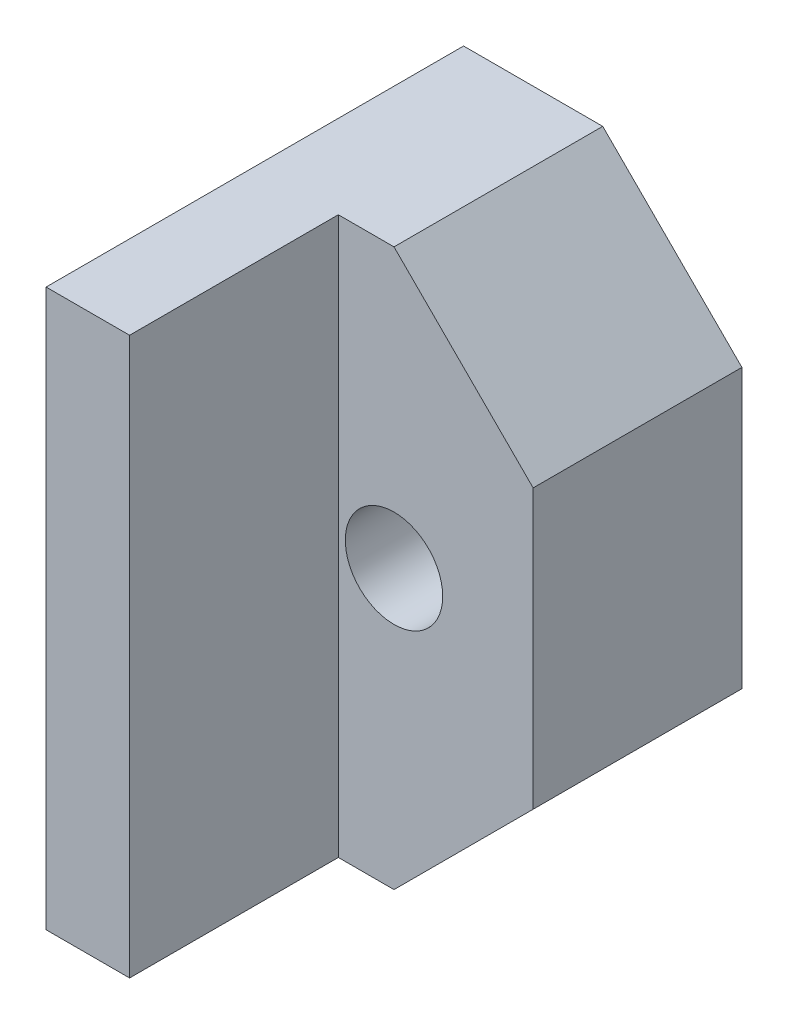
ISO-10303-21;
HEADER;
FILE_DESCRIPTION(('STEP AP214'),'2;1');
FILE_NAME('part.step','',(''),(''),'','','');
FILE_SCHEMA(('AUTOMOTIVE_DESIGN { 1 0 10303 214 1 1 1 1 }'));
ENDSEC;
DATA;
#1=APPLICATION_CONTEXT('core data for automotive mechanical design processes');
#2=APPLICATION_PROTOCOL_DEFINITION('international standard','automotive_design',2000,#1);
#3=PRODUCT_CONTEXT('',#1,'mechanical');
#4=PRODUCT('Part','Part','',(#3));
#5=PRODUCT_RELATED_PRODUCT_CATEGORY('part','',(#4));
#6=PRODUCT_DEFINITION_FORMATION('','',#4);
#7=PRODUCT_DEFINITION_CONTEXT('part definition',#1,'design');
#8=PRODUCT_DEFINITION('design','',#6,#7);
#9=PRODUCT_DEFINITION_SHAPE('','',#8);
#10=(LENGTH_UNIT() NAMED_UNIT(*) SI_UNIT(.MILLI.,.METRE.));
#11=(NAMED_UNIT(*) PLANE_ANGLE_UNIT() SI_UNIT($,.RADIAN.));
#12=(NAMED_UNIT(*) SI_UNIT($,.STERADIAN.) SOLID_ANGLE_UNIT());
#13=UNCERTAINTY_MEASURE_WITH_UNIT(LENGTH_MEASURE(1.E-05),#10,'distance_accuracy_value','');
#14=(GEOMETRIC_REPRESENTATION_CONTEXT(3) GLOBAL_UNCERTAINTY_ASSIGNED_CONTEXT((#13)) GLOBAL_UNIT_ASSIGNED_CONTEXT((#10,
#11,#12)) REPRESENTATION_CONTEXT('',''));
#15=CARTESIAN_POINT('',(0.,0.,0.));
#16=DIRECTION('',(0.,0.,1.));
#17=DIRECTION('',(1.,0.,0.));
#18=AXIS2_PLACEMENT_3D('',#15,#16,#17);
#19=CARTESIAN_POINT('',(4.,-2.,6.));
#20=DIRECTION('',(0.707106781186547,-0.707106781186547,0.));
#21=DIRECTION('',(0.707106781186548,0.707106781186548,0.));
#22=AXIS2_PLACEMENT_3D('',#19,#20,#21);
#23=PLANE('',#22);
#24=DIRECTION('',(0.,0.,-1.));
#25=VECTOR('',#24,1.);
#26=CARTESIAN_POINT('',(4.,-2.,6.));
#27=LINE('',#26,#25);
#28=CARTESIAN_POINT('',(4.,-2.,3.));
#29=VERTEX_POINT('',#28);
#30=CARTESIAN_POINT('',(4.,-2.,0.));
#31=VERTEX_POINT('',#30);
#32=EDGE_CURVE('E70',#29,#31,#27,.T.);
#33=ORIENTED_EDGE('',*,*,#32,.F.);
#34=DIRECTION('',(0.707106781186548,0.707106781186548,0.));
#35=VECTOR('',#34,1.);
#36=CARTESIAN_POINT('',(3.,-3.,3.));
#37=LINE('',#36,#35);
#38=CARTESIAN_POINT('',(2.,-4.,3.));
#39=VERTEX_POINT('',#38);
#40=EDGE_CURVE('E118',#39,#29,#37,.T.);
#41=ORIENTED_EDGE('',*,*,#40,.F.);
#42=DIRECTION('',(0.,0.,-1.));
#43=VECTOR('',#42,1.);
#44=CARTESIAN_POINT('',(2.,-4.,6.));
#45=LINE('',#44,#43);
#46=CARTESIAN_POINT('',(2.,-4.,0.));
#47=VERTEX_POINT('',#46);
#48=EDGE_CURVE('E12',#39,#47,#45,.T.);
#49=ORIENTED_EDGE('',*,*,#48,.T.);
#50=DIRECTION('',(-0.707106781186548,-0.707106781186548,0.));
#51=VECTOR('',#50,1.);
#52=CARTESIAN_POINT('',(4.,-2.,0.));
#53=LINE('',#52,#51);
#54=EDGE_CURVE('E115',#31,#47,#53,.T.);
#55=ORIENTED_EDGE('',*,*,#54,.F.);
#56=EDGE_LOOP('',(#33,#41,#49,#55));
#57=FACE_BOUND('',#56,.T.);
#58=ADVANCED_FACE('F60',(#57),#23,.T.);
#59=CARTESIAN_POINT('',(4.,2.,6.));
#60=DIRECTION('',(1.,0.,0.));
#61=DIRECTION('',(0.,0.,-1.));
#62=AXIS2_PLACEMENT_3D('',#59,#60,#61);
#63=PLANE('',#62);
#64=DIRECTION('',(0.,0.,-1.));
#65=VECTOR('',#64,1.);
#66=CARTESIAN_POINT('',(4.,2.,6.));
#67=LINE('',#66,#65);
#68=CARTESIAN_POINT('',(4.,2.,3.));
#69=VERTEX_POINT('',#68);
#70=CARTESIAN_POINT('',(4.,2.,0.));
#71=VERTEX_POINT('',#70);
#72=EDGE_CURVE('E151',#69,#71,#67,.T.);
#73=ORIENTED_EDGE('',*,*,#72,.F.);
#74=DIRECTION('',(0.,1.,0.));
#75=VECTOR('',#74,1.);
#76=CARTESIAN_POINT('',(4.,0.,3.));
#77=LINE('',#76,#75);
#78=EDGE_CURVE('E183',#29,#69,#77,.T.);
#79=ORIENTED_EDGE('',*,*,#78,.F.);
#80=ORIENTED_EDGE('',*,*,#32,.T.);
#81=DIRECTION('',(0.,-1.,0.));
#82=VECTOR('',#81,1.);
#83=CARTESIAN_POINT('',(4.,2.,0.));
#84=LINE('',#83,#82);
#85=EDGE_CURVE('E137',#71,#31,#84,.T.);
#86=ORIENTED_EDGE('',*,*,#85,.F.);
#87=EDGE_LOOP('',(#73,#79,#80,#86));
#88=FACE_BOUND('',#87,.T.);
#89=ADVANCED_FACE('F181',(#88),#63,.T.);
#90=CARTESIAN_POINT('',(2.,4.,6.));
#91=DIRECTION('',(0.707106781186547,0.707106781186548,0.));
#92=DIRECTION('',(-0.707106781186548,0.707106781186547,0.));
#93=AXIS2_PLACEMENT_3D('',#90,#91,#92);
#94=PLANE('',#93);
#95=DIRECTION('',(0.,0.,-1.));
#96=VECTOR('',#95,1.);
#97=CARTESIAN_POINT('',(2.,4.,6.));
#98=LINE('',#97,#96);
#99=CARTESIAN_POINT('',(2.,4.,3.));
#100=VERTEX_POINT('',#99);
#101=CARTESIAN_POINT('',(2.,4.,0.));
#102=VERTEX_POINT('',#101);
#103=EDGE_CURVE('E154',#100,#102,#98,.T.);
#104=ORIENTED_EDGE('',*,*,#103,.F.);
#105=DIRECTION('',(-0.707106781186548,0.707106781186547,0.));
#106=VECTOR('',#105,1.);
#107=CARTESIAN_POINT('',(3.,3.,3.));
#108=LINE('',#107,#106);
#109=EDGE_CURVE('E78',#69,#100,#108,.T.);
#110=ORIENTED_EDGE('',*,*,#109,.F.);
#111=ORIENTED_EDGE('',*,*,#72,.T.);
#112=DIRECTION('',(0.707106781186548,-0.707106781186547,0.));
#113=VECTOR('',#112,1.);
#114=CARTESIAN_POINT('',(2.,4.,0.));
#115=LINE('',#114,#113);
#116=EDGE_CURVE('E145',#102,#71,#115,.T.);
#117=ORIENTED_EDGE('',*,*,#116,.F.);
#118=EDGE_LOOP('',(#104,#110,#111,#117));
#119=FACE_BOUND('',#118,.T.);
#120=ADVANCED_FACE('F177',(#119),#94,.T.);
#121=CARTESIAN_POINT('',(2.,0.,6.));
#122=DIRECTION('',(0.,0.,-1.));
#123=DIRECTION('',(-1.,0.,0.));
#124=AXIS2_PLACEMENT_3D('',#121,#122,#123);
#125=CYLINDRICAL_SURFACE('',#124,0.7);
#126=CARTESIAN_POINT('',(2.,0.,0.));
#127=DIRECTION('',(0.,0.,1.));
#128=DIRECTION('',(1.,0.,0.));
#129=AXIS2_PLACEMENT_3D('',#126,#127,#128);
#130=CIRCLE('',#129,0.7);
#131=CARTESIAN_POINT('',(2.7,0.,0.));
#132=VERTEX_POINT('',#131);
#133=EDGE_CURVE('E130',#132,#132,#130,.T.);
#134=ORIENTED_EDGE('',*,*,#133,.F.);
#135=EDGE_LOOP('',(#134));
#136=FACE_BOUND('',#135,.T.);
#137=CARTESIAN_POINT('',(2.,0.,3.));
#138=DIRECTION('',(0.,0.,1.));
#139=DIRECTION('',(1.,0.,0.));
#140=AXIS2_PLACEMENT_3D('',#137,#138,#139);
#141=CIRCLE('',#140,0.7);
#142=CARTESIAN_POINT('',(2.7,0.,3.));
#143=VERTEX_POINT('',#142);
#144=EDGE_CURVE('E225',#143,#143,#141,.F.);
#145=ORIENTED_EDGE('',*,*,#144,.F.);
#146=EDGE_LOOP('',(#145));
#147=FACE_BOUND('',#146,.T.);
#148=ADVANCED_FACE('F233',(#136,#147),#125,.F.);
#149=CARTESIAN_POINT('',(0.,0.,6.));
#150=DIRECTION('',(0.,0.,-1.));
#151=DIRECTION('',(-1.,0.,0.));
#152=AXIS2_PLACEMENT_3D('',#149,#150,#151);
#153=PLANE('',#152);
#154=DIRECTION('',(-1.,0.,0.));
#155=VECTOR('',#154,1.);
#156=CARTESIAN_POINT('',(2.,-4.,6.));
#157=LINE('',#156,#155);
#158=CARTESIAN_POINT('',(1.2,-4.,6.));
#159=VERTEX_POINT('',#158);
#160=CARTESIAN_POINT('',(0.,-4.,6.));
#161=VERTEX_POINT('',#160);
#162=EDGE_CURVE('E139',#159,#161,#157,.T.);
#163=ORIENTED_EDGE('',*,*,#162,.F.);
#164=DIRECTION('',(0.,-1.,0.));
#165=VECTOR('',#164,1.);
#166=CARTESIAN_POINT('',(1.2,0.,6.));
#167=LINE('',#166,#165);
#168=CARTESIAN_POINT('',(1.2,4.,6.));
#169=VERTEX_POINT('',#168);
#170=EDGE_CURVE('E198',#169,#159,#167,.T.);
#171=ORIENTED_EDGE('',*,*,#170,.F.);
#172=DIRECTION('',(1.,0.,0.));
#173=VECTOR('',#172,1.);
#174=CARTESIAN_POINT('',(0.,4.,6.));
#175=LINE('',#174,#173);
#176=CARTESIAN_POINT('',(0.,4.,6.));
#177=VERTEX_POINT('',#176);
#178=EDGE_CURVE('E160',#177,#169,#175,.T.);
#179=ORIENTED_EDGE('',*,*,#178,.F.);
#180=DIRECTION('',(0.,1.,0.));
#181=VECTOR('',#180,1.);
#182=CARTESIAN_POINT('',(0.,-4.,6.));
#183=LINE('',#182,#181);
#184=EDGE_CURVE('E143',#161,#177,#183,.T.);
#185=ORIENTED_EDGE('',*,*,#184,.F.);
#186=EDGE_LOOP('',(#163,#171,#179,#185));
#187=FACE_BOUND('',#186,.T.);
#188=ADVANCED_FACE('F236',(#187),#153,.F.);
#189=CARTESIAN_POINT('',(0.,0.,0.));
#190=DIRECTION('',(0.,0.,-1.));
#191=DIRECTION('',(-1.,0.,0.));
#192=AXIS2_PLACEMENT_3D('',#189,#190,#191);
#193=PLANE('',#192);
#194=DIRECTION('',(-1.,0.,0.));
#195=VECTOR('',#194,1.);
#196=CARTESIAN_POINT('',(2.,-4.,0.));
#197=LINE('',#196,#195);
#198=CARTESIAN_POINT('',(0.,-4.,0.));
#199=VERTEX_POINT('',#198);
#200=EDGE_CURVE('E122',#47,#199,#197,.T.);
#201=ORIENTED_EDGE('',*,*,#200,.T.);
#202=DIRECTION('',(0.,1.,0.));
#203=VECTOR('',#202,1.);
#204=CARTESIAN_POINT('',(0.,-4.,0.));
#205=LINE('',#204,#203);
#206=CARTESIAN_POINT('',(0.,4.,0.));
#207=VERTEX_POINT('',#206);
#208=EDGE_CURVE('E129',#199,#207,#205,.T.);
#209=ORIENTED_EDGE('',*,*,#208,.T.);
#210=DIRECTION('',(1.,0.,0.));
#211=VECTOR('',#210,1.);
#212=CARTESIAN_POINT('',(0.,4.,0.));
#213=LINE('',#212,#211);
#214=EDGE_CURVE('E170',#207,#102,#213,.T.);
#215=ORIENTED_EDGE('',*,*,#214,.T.);
#216=ORIENTED_EDGE('',*,*,#116,.T.);
#217=ORIENTED_EDGE('',*,*,#85,.T.);
#218=ORIENTED_EDGE('',*,*,#54,.T.);
#219=EDGE_LOOP('',(#201,#209,#215,#216,#217,#218));
#220=FACE_BOUND('',#219,.T.);
#221=ORIENTED_EDGE('',*,*,#133,.T.);
#222=EDGE_LOOP('',(#221));
#223=FACE_BOUND('',#222,.T.);
#224=ADVANCED_FACE('F133',(#220,#223),#193,.T.);
#225=CARTESIAN_POINT('',(2.,-4.,6.));
#226=DIRECTION('',(0.,-1.,0.));
#227=DIRECTION('',(0.,0.,-1.));
#228=AXIS2_PLACEMENT_3D('',#225,#226,#227);
#229=PLANE('',#228);
#230=DIRECTION('',(0.,0.,1.));
#231=VECTOR('',#230,1.);
#232=CARTESIAN_POINT('',(1.2,-4.,3.));
#233=LINE('',#232,#231);
#234=CARTESIAN_POINT('',(1.2,-4.,3.));
#235=VERTEX_POINT('',#234);
#236=EDGE_CURVE('E203',#235,#159,#233,.T.);
#237=ORIENTED_EDGE('',*,*,#236,.T.);
#238=ORIENTED_EDGE('',*,*,#162,.T.);
#239=DIRECTION('',(0.,0.,-1.));
#240=VECTOR('',#239,1.);
#241=CARTESIAN_POINT('',(0.,-4.,6.));
#242=LINE('',#241,#240);
#243=EDGE_CURVE('E64',#161,#199,#242,.T.);
#244=ORIENTED_EDGE('',*,*,#243,.T.);
#245=ORIENTED_EDGE('',*,*,#200,.F.);
#246=ORIENTED_EDGE('',*,*,#48,.F.);
#247=DIRECTION('',(1.,0.,0.));
#248=VECTOR('',#247,1.);
#249=CARTESIAN_POINT('',(0.,-4.,3.));
#250=LINE('',#249,#248);
#251=EDGE_CURVE('E210',#235,#39,#250,.T.);
#252=ORIENTED_EDGE('',*,*,#251,.F.);
#253=EDGE_LOOP('',(#237,#238,#244,#245,#246,#252));
#254=FACE_BOUND('',#253,.T.);
#255=ADVANCED_FACE('F62',(#254),#229,.T.);
#256=CARTESIAN_POINT('',(0.,4.,6.));
#257=DIRECTION('',(0.,1.,0.));
#258=DIRECTION('',(0.,0.,1.));
#259=AXIS2_PLACEMENT_3D('',#256,#257,#258);
#260=PLANE('',#259);
#261=DIRECTION('',(0.,0.,1.));
#262=VECTOR('',#261,1.);
#263=CARTESIAN_POINT('',(1.2,4.,3.));
#264=LINE('',#263,#262);
#265=CARTESIAN_POINT('',(1.2,4.,3.));
#266=VERTEX_POINT('',#265);
#267=EDGE_CURVE('E207',#266,#169,#264,.T.);
#268=ORIENTED_EDGE('',*,*,#267,.F.);
#269=DIRECTION('',(-1.,0.,0.));
#270=VECTOR('',#269,1.);
#271=CARTESIAN_POINT('',(0.,4.,3.));
#272=LINE('',#271,#270);
#273=EDGE_CURVE('E211',#100,#266,#272,.T.);
#274=ORIENTED_EDGE('',*,*,#273,.F.);
#275=ORIENTED_EDGE('',*,*,#103,.T.);
#276=ORIENTED_EDGE('',*,*,#214,.F.);
#277=DIRECTION('',(0.,0.,-1.));
#278=VECTOR('',#277,1.);
#279=CARTESIAN_POINT('',(0.,4.,6.));
#280=LINE('',#279,#278);
#281=EDGE_CURVE('E87',#177,#207,#280,.T.);
#282=ORIENTED_EDGE('',*,*,#281,.F.);
#283=ORIENTED_EDGE('',*,*,#178,.T.);
#284=EDGE_LOOP('',(#268,#274,#275,#276,#282,#283));
#285=FACE_BOUND('',#284,.T.);
#286=ADVANCED_FACE('F262',(#285),#260,.T.);
#287=CARTESIAN_POINT('',(0.,-4.,6.));
#288=DIRECTION('',(-1.,0.,0.));
#289=DIRECTION('',(0.,0.,1.));
#290=AXIS2_PLACEMENT_3D('',#287,#288,#289);
#291=PLANE('',#290);
#292=ORIENTED_EDGE('',*,*,#208,.F.);
#293=ORIENTED_EDGE('',*,*,#243,.F.);
#294=ORIENTED_EDGE('',*,*,#184,.T.);
#295=ORIENTED_EDGE('',*,*,#281,.T.);
#296=EDGE_LOOP('',(#292,#293,#294,#295));
#297=FACE_BOUND('',#296,.T.);
#298=ADVANCED_FACE('F249',(#297),#291,.T.);
#299=CARTESIAN_POINT('',(1.2,0.,3.));
#300=DIRECTION('',(-1.,0.,0.));
#301=DIRECTION('',(0.,-1.,0.));
#302=AXIS2_PLACEMENT_3D('',#299,#300,#301);
#303=PLANE('',#302);
#304=ORIENTED_EDGE('',*,*,#170,.T.);
#305=ORIENTED_EDGE('',*,*,#236,.F.);
#306=DIRECTION('',(0.,-1.,0.));
#307=VECTOR('',#306,1.);
#308=CARTESIAN_POINT('',(1.2,0.,3.));
#309=LINE('',#308,#307);
#310=EDGE_CURVE('E202',#266,#235,#309,.T.);
#311=ORIENTED_EDGE('',*,*,#310,.F.);
#312=ORIENTED_EDGE('',*,*,#267,.T.);
#313=EDGE_LOOP('',(#304,#305,#311,#312));
#314=FACE_BOUND('',#313,.T.);
#315=ADVANCED_FACE('F204',(#314),#303,.F.);
#316=CARTESIAN_POINT('',(0.,0.,3.));
#317=DIRECTION('',(0.,0.,1.));
#318=DIRECTION('',(1.,0.,0.));
#319=AXIS2_PLACEMENT_3D('',#316,#317,#318);
#320=PLANE('',#319);
#321=ORIENTED_EDGE('',*,*,#144,.T.);
#322=EDGE_LOOP('',(#321));
#323=FACE_BOUND('',#322,.T.);
#324=ORIENTED_EDGE('',*,*,#273,.T.);
#325=ORIENTED_EDGE('',*,*,#310,.T.);
#326=ORIENTED_EDGE('',*,*,#251,.T.);
#327=ORIENTED_EDGE('',*,*,#40,.T.);
#328=ORIENTED_EDGE('',*,*,#78,.T.);
#329=ORIENTED_EDGE('',*,*,#109,.T.);
#330=EDGE_LOOP('',(#324,#325,#326,#327,#328,#329));
#331=FACE_BOUND('',#330,.T.);
#332=ADVANCED_FACE('F209',(#323,#331),#320,.T.);
#333=CLOSED_SHELL('',(#58,#89,#120,#148,#188,#224,#255,#286,#298,#315,#332));
#334=MANIFOLD_SOLID_BREP('B2',#333);
#335=ADVANCED_BREP_SHAPE_REPRESENTATION('',(#18,#334),#14);
#336=SHAPE_DEFINITION_REPRESENTATION(#9,#335);
ENDSEC;
END-ISO-10303-21;
